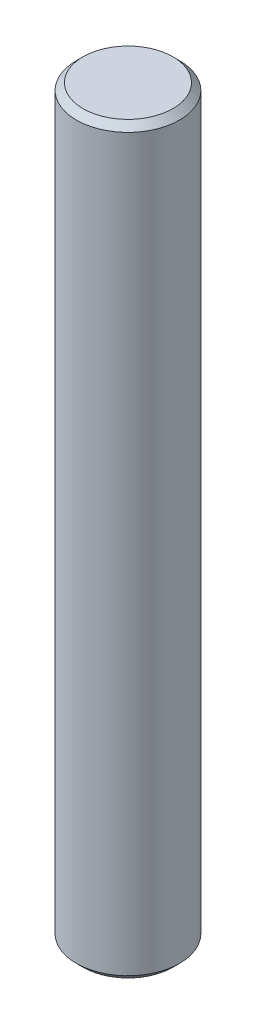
from build123d import *

# Parameters (mm, degrees)
SKETCH1_R      = 1.9812
EXTRUDE1_DEPTH = 14.2875
CHAMFER1_SIZE  = 0.254


with BuildPart() as part:
    # Sketch1 → Extrude1 (new, symmetric)
    with BuildSketch(Plane(origin=(0, 0, 0), x_dir=(1, 0, 0), z_dir=(0, 1, 0))):
        with Locations(Location((0, 0, 0), (0, 0, 270))):
            Circle(SKETCH1_R)
    extrude(amount=EXTRUDE1_DEPTH, both=True)

    # Chamfer1
    chamfer1_edges = [part.edges().sort_by_distance(p)[0] for p in [
        (0, -14.2875, -1.9812),
        (0, 14.2875, -1.9812),
    ]]
    chamfer(chamfer1_edges, length=CHAMFER1_SIZE)


solid = part.part
